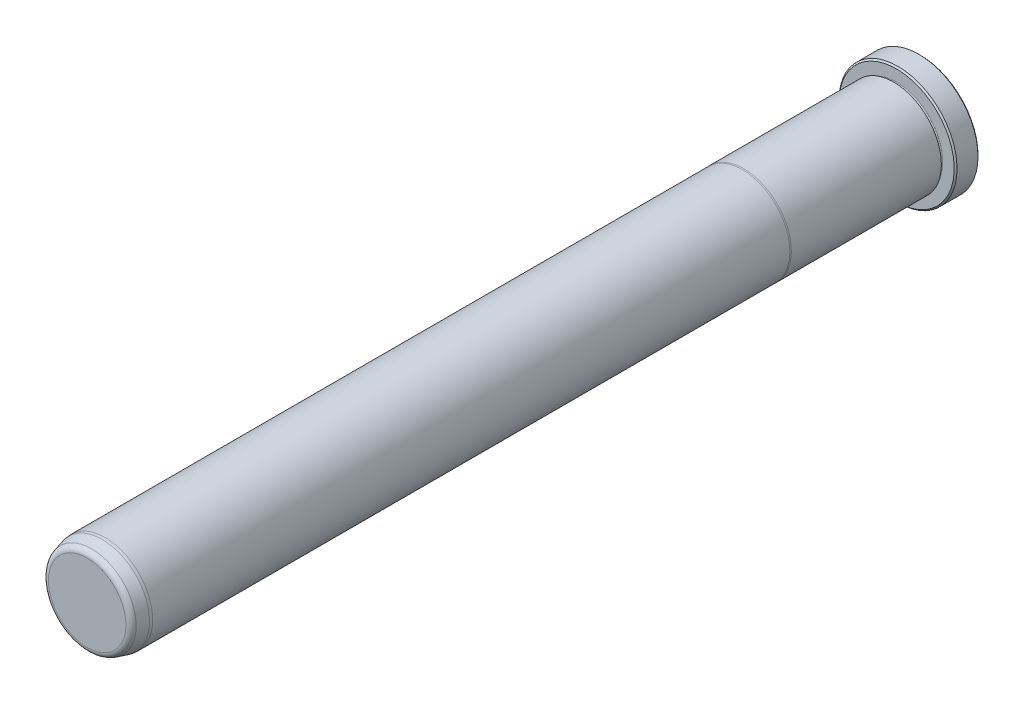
ISO-10303-21;
HEADER;
FILE_DESCRIPTION(('STEP AP214'),'2;1');
FILE_NAME('part.step','',(''),(''),'','','');
FILE_SCHEMA(('AUTOMOTIVE_DESIGN { 1 0 10303 214 1 1 1 1 }'));
ENDSEC;
DATA;
#1=APPLICATION_CONTEXT('core data for automotive mechanical design processes');
#2=APPLICATION_PROTOCOL_DEFINITION('international standard','automotive_design',2000,#1);
#3=PRODUCT_CONTEXT('',#1,'mechanical');
#4=PRODUCT('Part','Part','',(#3));
#5=PRODUCT_RELATED_PRODUCT_CATEGORY('part','',(#4));
#6=PRODUCT_DEFINITION_FORMATION('','',#4);
#7=PRODUCT_DEFINITION_CONTEXT('part definition',#1,'design');
#8=PRODUCT_DEFINITION('design','',#6,#7);
#9=PRODUCT_DEFINITION_SHAPE('','',#8);
#10=(LENGTH_UNIT() NAMED_UNIT(*) SI_UNIT(.MILLI.,.METRE.));
#11=(NAMED_UNIT(*) PLANE_ANGLE_UNIT() SI_UNIT($,.RADIAN.));
#12=(NAMED_UNIT(*) SI_UNIT($,.STERADIAN.) SOLID_ANGLE_UNIT());
#13=UNCERTAINTY_MEASURE_WITH_UNIT(LENGTH_MEASURE(1.E-05),#10,'distance_accuracy_value','');
#14=(GEOMETRIC_REPRESENTATION_CONTEXT(3) GLOBAL_UNCERTAINTY_ASSIGNED_CONTEXT((#13)) GLOBAL_UNIT_ASSIGNED_CONTEXT((#10,
#11,#12)) REPRESENTATION_CONTEXT('',''));
#15=CARTESIAN_POINT('',(0.,0.,0.));
#16=DIRECTION('',(0.,0.,1.));
#17=DIRECTION('',(1.,0.,0.));
#18=AXIS2_PLACEMENT_3D('',#15,#16,#17);
#19=CARTESIAN_POINT('',(0.,0.,0.));
#20=DIRECTION('',(0.,0.,1.));
#21=DIRECTION('',(1.,0.,0.));
#22=AXIS2_PLACEMENT_3D('',#19,#20,#21);
#23=PLANE('',#22);
#24=CARTESIAN_POINT('',(0.,0.,0.));
#25=DIRECTION('',(0.,0.,1.));
#26=DIRECTION('',(1.,0.,0.));
#27=AXIS2_PLACEMENT_3D('',#24,#25,#26);
#28=CIRCLE('',#27,15.367);
#29=CARTESIAN_POINT('',(15.367,0.,0.));
#30=VERTEX_POINT('',#29);
#31=EDGE_CURVE('E37',#30,#30,#28,.F.);
#32=ORIENTED_EDGE('',*,*,#31,.T.);
#33=EDGE_LOOP('',(#32));
#34=FACE_BOUND('',#33,.T.);
#35=ADVANCED_FACE('F30',(#34),#23,.F.);
#36=CARTESIAN_POINT('',(0.,0.,0.));
#37=DIRECTION('',(0.,0.,1.));
#38=DIRECTION('',(1.,0.,0.));
#39=AXIS2_PLACEMENT_3D('',#36,#37,#38);
#40=CYLINDRICAL_SURFACE('',#39,15.748);
#41=CARTESIAN_POINT('',(0.,0.,0.381000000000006));
#42=DIRECTION('',(0.,0.,1.));
#43=DIRECTION('',(1.,0.,0.));
#44=AXIS2_PLACEMENT_3D('',#41,#42,#43);
#45=CIRCLE('',#44,15.748);
#46=CARTESIAN_POINT('',(15.748,0.,0.381000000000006));
#47=VERTEX_POINT('',#46);
#48=EDGE_CURVE('E41',#47,#47,#45,.T.);
#49=ORIENTED_EDGE('',*,*,#48,.T.);
#50=EDGE_LOOP('',(#49));
#51=FACE_BOUND('',#50,.T.);
#52=CARTESIAN_POINT('',(0.,0.,5.96900000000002));
#53=DIRECTION('',(0.,0.,-1.));
#54=DIRECTION('',(-1.,0.,0.));
#55=AXIS2_PLACEMENT_3D('',#52,#53,#54);
#56=CIRCLE('',#55,15.748);
#57=CARTESIAN_POINT('',(-15.748,0.,5.96900000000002));
#58=VERTEX_POINT('',#57);
#59=EDGE_CURVE('E45',#58,#58,#56,.T.);
#60=ORIENTED_EDGE('',*,*,#59,.T.);
#61=EDGE_LOOP('',(#60));
#62=FACE_BOUND('',#61,.T.);
#63=ADVANCED_FACE('F118',(#51,#62),#40,.T.);
#64=CARTESIAN_POINT('',(0.,15.748,6.35));
#65=DIRECTION('',(0.,0.,-1.));
#66=DIRECTION('',(-1.,0.,0.));
#67=AXIS2_PLACEMENT_3D('',#64,#65,#66);
#68=PLANE('',#67);
#69=CARTESIAN_POINT('',(0.,0.,6.35));
#70=DIRECTION('',(0.,0.,-1.));
#71=DIRECTION('',(-1.,0.,0.));
#72=AXIS2_PLACEMENT_3D('',#69,#70,#71);
#73=CIRCLE('',#72,15.367);
#74=CARTESIAN_POINT('',(-15.367,0.,6.35));
#75=VERTEX_POINT('',#74);
#76=EDGE_CURVE('E10',#75,#75,#73,.F.);
#77=ORIENTED_EDGE('',*,*,#76,.T.);
#78=EDGE_LOOP('',(#77));
#79=FACE_BOUND('',#78,.T.);
#80=CARTESIAN_POINT('',(0.,0.,6.35));
#81=DIRECTION('',(0.,0.,1.));
#82=DIRECTION('',(1.,0.,0.));
#83=AXIS2_PLACEMENT_3D('',#80,#81,#82);
#84=CIRCLE('',#83,12.3063);
#85=CARTESIAN_POINT('',(12.3063,0.,6.35));
#86=VERTEX_POINT('',#85);
#87=EDGE_CURVE('E56',#86,#86,#84,.T.);
#88=ORIENTED_EDGE('',*,*,#87,.F.);
#89=EDGE_LOOP('',(#88));
#90=FACE_BOUND('',#89,.T.);
#91=ADVANCED_FACE('F113',(#79,#90),#68,.F.);
#92=CARTESIAN_POINT('',(0.,0.,6.731));
#93=DIRECTION('',(0.,0.,1.));
#94=DIRECTION('',(1.,0.,0.));
#95=AXIS2_PLACEMENT_3D('',#92,#93,#94);
#96=TOROIDAL_SURFACE('',#95,12.3063,0.381);
#97=CARTESIAN_POINT('',(0.,0.,7.112));
#98=DIRECTION('',(0.,0.,1.));
#99=DIRECTION('',(1.,0.,0.));
#100=AXIS2_PLACEMENT_3D('',#97,#98,#99);
#101=CIRCLE('',#100,12.3063);
#102=CARTESIAN_POINT('',(12.3063,0.,7.112));
#103=VERTEX_POINT('',#102);
#104=EDGE_CURVE('E59',#103,#103,#101,.T.);
#105=ORIENTED_EDGE('',*,*,#104,.F.);
#106=EDGE_LOOP('',(#105));
#107=FACE_BOUND('',#106,.T.);
#108=ORIENTED_EDGE('',*,*,#87,.T.);
#109=EDGE_LOOP('',(#108));
#110=FACE_BOUND('',#109,.T.);
#111=ADVANCED_FACE('F107',(#107,#110),#96,.F.);
#112=CARTESIAN_POINT('',(0.,12.3063,7.112));
#113=DIRECTION('',(0.,0.,1.));
#114=DIRECTION('',(1.,0.,0.));
#115=AXIS2_PLACEMENT_3D('',#112,#113,#114);
#116=PLANE('',#115);
#117=CARTESIAN_POINT('',(0.,0.,7.112));
#118=DIRECTION('',(0.,0.,1.));
#119=DIRECTION('',(1.,0.,0.));
#120=AXIS2_PLACEMENT_3D('',#117,#118,#119);
#121=CIRCLE('',#120,12.7127);
#122=CARTESIAN_POINT('',(12.7127,0.,7.112));
#123=VERTEX_POINT('',#122);
#124=EDGE_CURVE('E62',#123,#123,#121,.T.);
#125=ORIENTED_EDGE('',*,*,#124,.F.);
#126=EDGE_LOOP('',(#125));
#127=FACE_BOUND('',#126,.T.);
#128=ORIENTED_EDGE('',*,*,#104,.T.);
#129=EDGE_LOOP('',(#128));
#130=FACE_BOUND('',#129,.T.);
#131=ADVANCED_FACE('F101',(#127,#130),#116,.F.);
#132=CARTESIAN_POINT('',(0.,0.,0.));
#133=DIRECTION('',(0.,0.,1.));
#134=DIRECTION('',(1.,0.,0.));
#135=AXIS2_PLACEMENT_3D('',#132,#133,#134);
#136=CYLINDRICAL_SURFACE('',#135,12.7127);
#137=CARTESIAN_POINT('',(0.,0.,47.1347630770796));
#138=DIRECTION('',(0.,0.,1.));
#139=DIRECTION('',(1.,0.,0.));
#140=AXIS2_PLACEMENT_3D('',#137,#138,#139);
#141=CIRCLE('',#140,12.7127);
#142=CARTESIAN_POINT('',(12.7127,0.,47.1347630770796));
#143=VERTEX_POINT('',#142);
#144=EDGE_CURVE('E65',#143,#143,#141,.T.);
#145=ORIENTED_EDGE('',*,*,#144,.F.);
#146=EDGE_LOOP('',(#145));
#147=FACE_BOUND('',#146,.T.);
#148=ORIENTED_EDGE('',*,*,#124,.T.);
#149=EDGE_LOOP('',(#148));
#150=FACE_BOUND('',#149,.T.);
#151=ADVANCED_FACE('F95',(#147,#150),#136,.T.);
#152=CARTESIAN_POINT('',(0.,0.,47.1347630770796));
#153=DIRECTION('',(0.,0.,-1.));
#154=DIRECTION('',(-1.,0.,0.));
#155=AXIS2_PLACEMENT_3D('',#152,#153,#154);
#156=CONICAL_SURFACE('',#155,12.7127,0.0698131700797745);
#157=CARTESIAN_POINT('',(0.,0.,47.498));
#158=DIRECTION('',(0.,0.,1.));
#159=DIRECTION('',(1.,0.,0.));
#160=AXIS2_PLACEMENT_3D('',#157,#158,#159);
#161=CIRCLE('',#160,12.6873);
#162=CARTESIAN_POINT('',(12.6873,0.,47.498));
#163=VERTEX_POINT('',#162);
#164=EDGE_CURVE('E68',#163,#163,#161,.T.);
#165=ORIENTED_EDGE('',*,*,#164,.F.);
#166=EDGE_LOOP('',(#165));
#167=FACE_BOUND('',#166,.T.);
#168=ORIENTED_EDGE('',*,*,#144,.T.);
#169=EDGE_LOOP('',(#168));
#170=FACE_BOUND('',#169,.T.);
#171=ADVANCED_FACE('F89',(#167,#170),#156,.T.);
#172=CARTESIAN_POINT('',(0.,0.,0.));
#173=DIRECTION('',(0.,0.,1.));
#174=DIRECTION('',(1.,0.,0.));
#175=AXIS2_PLACEMENT_3D('',#172,#173,#174);
#176=CYLINDRICAL_SURFACE('',#175,12.6873);
#177=CARTESIAN_POINT('',(0.,0.,217.4875));
#178=DIRECTION('',(0.,0.,1.));
#179=DIRECTION('',(1.,0.,0.));
#180=AXIS2_PLACEMENT_3D('',#177,#178,#179);
#181=CIRCLE('',#180,12.6873);
#182=CARTESIAN_POINT('',(12.6873,0.,217.4875));
#183=VERTEX_POINT('',#182);
#184=EDGE_CURVE('E71',#183,#183,#181,.T.);
#185=ORIENTED_EDGE('',*,*,#184,.F.);
#186=EDGE_LOOP('',(#185));
#187=FACE_BOUND('',#186,.T.);
#188=ORIENTED_EDGE('',*,*,#164,.T.);
#189=EDGE_LOOP('',(#188));
#190=FACE_BOUND('',#189,.T.);
#191=ADVANCED_FACE('F83',(#187,#190),#176,.T.);
#192=CARTESIAN_POINT('',(0.,0.,217.4875));
#193=DIRECTION('',(0.,0.,-1.));
#194=DIRECTION('',(-1.,0.,0.));
#195=AXIS2_PLACEMENT_3D('',#192,#193,#194);
#196=CONICAL_SURFACE('',#195,12.6873,0.0872664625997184);
#197=CARTESIAN_POINT('',(0.,0.,218.2495));
#198=DIRECTION('',(0.,0.,1.));
#199=DIRECTION('',(1.,0.,0.));
#200=AXIS2_PLACEMENT_3D('',#197,#198,#199);
#201=CIRCLE('',#200,12.6206336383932);
#202=CARTESIAN_POINT('',(12.6206336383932,0.,218.2495));
#203=VERTEX_POINT('',#202);
#204=EDGE_CURVE('E74',#203,#203,#201,.T.);
#205=ORIENTED_EDGE('',*,*,#204,.F.);
#206=EDGE_LOOP('',(#205));
#207=FACE_BOUND('',#206,.T.);
#208=ORIENTED_EDGE('',*,*,#184,.T.);
#209=EDGE_LOOP('',(#208));
#210=FACE_BOUND('',#209,.T.);
#211=ADVANCED_FACE('F80',(#207,#210),#196,.T.);
#212=CARTESIAN_POINT('',(0.,0.,218.2495));
#213=DIRECTION('',(0.,0.,-1.));
#214=DIRECTION('',(-1.,0.,0.));
#215=AXIS2_PLACEMENT_3D('',#212,#213,#214);
#216=CONICAL_SURFACE('',#215,12.6206336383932,0.26179938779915);
#217=CARTESIAN_POINT('',(0.,0.,221.0733752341));
#218=DIRECTION('',(0.,0.,1.));
#219=DIRECTION('',(1.,0.,0.));
#220=AXIS2_PLACEMENT_3D('',#217,#218,#219);
#221=CIRCLE('',#220,11.8639785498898);
#222=CARTESIAN_POINT('',(11.8639785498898,0.,221.0733752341));
#223=VERTEX_POINT('',#222);
#224=EDGE_CURVE('E50',#223,#223,#221,.F.);
#225=ORIENTED_EDGE('',*,*,#224,.T.);
#226=EDGE_LOOP('',(#225));
#227=FACE_BOUND('',#226,.T.);
#228=ORIENTED_EDGE('',*,*,#204,.T.);
#229=EDGE_LOOP('',(#228));
#230=FACE_BOUND('',#229,.T.);
#231=ADVANCED_FACE('F78',(#227,#230),#216,.T.);
#232=CARTESIAN_POINT('',(0.,11.5487028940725,222.25));
#233=DIRECTION('',(0.,0.,-1.));
#234=DIRECTION('',(-1.,0.,0.));
#235=AXIS2_PLACEMENT_3D('',#232,#233,#234);
#236=PLANE('',#235);
#237=CARTESIAN_POINT('',(0.,0.,222.25));
#238=DIRECTION('',(0.,0.,-1.));
#239=DIRECTION('',(-1.,0.,0.));
#240=AXIS2_PLACEMENT_3D('',#237,#238,#239);
#241=CIRCLE('',#240,10.3305713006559);
#242=CARTESIAN_POINT('',(-10.3305713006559,0.,222.25));
#243=VERTEX_POINT('',#242);
#244=EDGE_CURVE('E53',#243,#243,#241,.F.);
#245=ORIENTED_EDGE('',*,*,#244,.T.);
#246=EDGE_LOOP('',(#245));
#247=FACE_BOUND('',#246,.T.);
#248=ADVANCED_FACE('F133',(#247),#236,.F.);
#249=CARTESIAN_POINT('',(0.,0.,220.6625));
#250=DIRECTION('',(0.,0.,-1.));
#251=DIRECTION('',(-1.,0.,0.));
#252=AXIS2_PLACEMENT_3D('',#249,#250,#251);
#253=TOROIDAL_SURFACE('',#252,10.3305713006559,1.5875);
#254=ORIENTED_EDGE('',*,*,#224,.F.);
#255=EDGE_LOOP('',(#254));
#256=FACE_BOUND('',#255,.T.);
#257=ORIENTED_EDGE('',*,*,#244,.F.);
#258=EDGE_LOOP('',(#257));
#259=FACE_BOUND('',#258,.T.);
#260=ADVANCED_FACE('F130',(#256,#259),#253,.T.);
#261=CARTESIAN_POINT('',(0.,0.,0.381000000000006));
#262=DIRECTION('',(0.,0.,1.));
#263=DIRECTION('',(1.,0.,0.));
#264=AXIS2_PLACEMENT_3D('',#261,#262,#263);
#265=CONICAL_SURFACE('',#264,15.748,0.785398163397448);
#266=CARTESIAN_POINT('',(15.367,0.,0.));
#267=CARTESIAN_POINT('',(15.37096875,0.,0.00396874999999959));
#268=CARTESIAN_POINT('',(15.3749375,0.,0.00793749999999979));
#269=CARTESIAN_POINT('',(15.382875,0.,0.0158750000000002));
#270=CARTESIAN_POINT('',(15.38684375,0.,0.0198437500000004));
#271=CARTESIAN_POINT('',(15.39478125,0.,0.0277812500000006));
#272=CARTESIAN_POINT('',(15.39875,0.,0.0317500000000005));
#273=CARTESIAN_POINT('',(15.4066875,0.,0.0396875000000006));
#274=CARTESIAN_POINT('',(15.41065625,0.,0.0436562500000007));
#275=CARTESIAN_POINT('',(15.41859375,0.,0.0515937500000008));
#276=CARTESIAN_POINT('',(15.4225625,0.,0.0555625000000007));
#277=CARTESIAN_POINT('',(15.4305,0.,0.0635000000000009));
#278=CARTESIAN_POINT('',(15.43446875,0.,0.0674687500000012));
#279=CARTESIAN_POINT('',(15.44240625,0.,0.0754062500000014));
#280=CARTESIAN_POINT('',(15.446375,0.,0.0793750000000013));
#281=CARTESIAN_POINT('',(15.4543125,0.,0.0873125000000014));
#282=CARTESIAN_POINT('',(15.45828125,0.,0.0912812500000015));
#283=CARTESIAN_POINT('',(15.46621875,0.,0.0992187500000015));
#284=CARTESIAN_POINT('',(15.4701875,0.,0.103187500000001));
#285=CARTESIAN_POINT('',(15.478125,0.,0.111125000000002));
#286=CARTESIAN_POINT('',(15.48209375,0.,0.115093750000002));
#287=CARTESIAN_POINT('',(15.49003125,0.,0.123031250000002));
#288=CARTESIAN_POINT('',(15.494,0.,0.127000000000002));
#289=CARTESIAN_POINT('',(15.5019375,0.,0.134937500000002));
#290=CARTESIAN_POINT('',(15.50590625,0.,0.138906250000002));
#291=CARTESIAN_POINT('',(15.51384375,0.,0.146843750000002));
#292=CARTESIAN_POINT('',(15.5178125,0.,0.150812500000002));
#293=CARTESIAN_POINT('',(15.52575,0.,0.158750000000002));
#294=CARTESIAN_POINT('',(15.52971875,0.,0.162718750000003));
#295=CARTESIAN_POINT('',(15.53765625,0.,0.170656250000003));
#296=CARTESIAN_POINT('',(15.541625,0.,0.174625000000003));
#297=CARTESIAN_POINT('',(15.5495625,0.,0.182562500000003));
#298=CARTESIAN_POINT('',(15.55353125,0.,0.186531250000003));
#299=CARTESIAN_POINT('',(15.56146875,0.,0.194468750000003));
#300=CARTESIAN_POINT('',(15.5654375,0.,0.198437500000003));
#301=CARTESIAN_POINT('',(15.573375,0.,0.206375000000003));
#302=CARTESIAN_POINT('',(15.57734375,0.,0.210343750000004));
#303=CARTESIAN_POINT('',(15.58528125,0.,0.218281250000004));
#304=CARTESIAN_POINT('',(15.58925,0.,0.222250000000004));
#305=CARTESIAN_POINT('',(15.5971875,0.,0.230187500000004));
#306=CARTESIAN_POINT('',(15.60115625,0.,0.234156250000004));
#307=CARTESIAN_POINT('',(15.60909375,0.,0.242093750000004));
#308=CARTESIAN_POINT('',(15.6130625,0.,0.246062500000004));
#309=CARTESIAN_POINT('',(15.621,0.,0.254000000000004));
#310=CARTESIAN_POINT('',(15.62496875,0.,0.257968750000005));
#311=CARTESIAN_POINT('',(15.63290625,0.,0.265906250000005));
#312=CARTESIAN_POINT('',(15.636875,0.,0.269875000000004));
#313=CARTESIAN_POINT('',(15.6448125,0.,0.277812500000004));
#314=CARTESIAN_POINT('',(15.64878125,0.,0.281781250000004));
#315=CARTESIAN_POINT('',(15.65671875,0.,0.289718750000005));
#316=CARTESIAN_POINT('',(15.6606875,0.,0.293687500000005));
#317=CARTESIAN_POINT('',(15.668625,0.,0.301625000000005));
#318=CARTESIAN_POINT('',(15.67259375,0.,0.305593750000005));
#319=CARTESIAN_POINT('',(15.68053125,0.,0.313531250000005));
#320=CARTESIAN_POINT('',(15.6845,0.,0.317500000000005));
#321=CARTESIAN_POINT('',(15.6924375,0.,0.325437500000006));
#322=CARTESIAN_POINT('',(15.69640625,0.,0.329406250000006));
#323=CARTESIAN_POINT('',(15.70434375,0.,0.337343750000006));
#324=CARTESIAN_POINT('',(15.7083125,0.,0.341312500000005));
#325=CARTESIAN_POINT('',(15.71625,0.,0.349250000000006));
#326=CARTESIAN_POINT('',(15.72021875,0.,0.353218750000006));
#327=CARTESIAN_POINT('',(15.72815625,0.,0.361156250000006));
#328=CARTESIAN_POINT('',(15.732125,0.,0.365125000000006));
#329=CARTESIAN_POINT('',(15.7400625,0.,0.373062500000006));
#330=CARTESIAN_POINT('',(15.74403125,0.,0.377031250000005));
#331=CARTESIAN_POINT('',(15.748,0.,0.381000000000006));
#332=B_SPLINE_CURVE_WITH_KNOTS('',3,(#266,#267,#268,#269,#270,#271,#272,#273,#274,#275,#276,
#277,#278,#279,#280,#281,#282,#283,#284,#285,#286,#287,#288,#289,#290,#291,#292,#293,#294,#295,
#296,#297,#298,#299,#300,#301,#302,#303,#304,#305,#306,#307,#308,#309,#310,#311,#312,#313,#314,
#315,#316,#317,#318,#319,#320,#321,#322,#323,#324,#325,#326,#327,#328,#329,#330,#331),
.UNSPECIFIED.,.F.,.F.,(4,2,2,2,2,2,2,2,2,2,2,2,2,2,2,2,2,2,2,2,2,2,2,2,2,2,2,2,2,2,2,2,4),(0.,
0.0168379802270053,0.0336759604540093,0.0505139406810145,0.0673519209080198,0.084189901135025,
0.101027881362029,0.117865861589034,0.13470384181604,0.151541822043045,0.168379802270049,
0.185217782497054,0.202055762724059,0.218893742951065,0.235731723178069,0.252569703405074,
0.269407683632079,0.286245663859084,0.303083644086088,0.319921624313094,0.336759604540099,
0.353597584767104,0.370435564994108,0.387273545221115,0.404111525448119,0.420949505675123,
0.437787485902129,0.454625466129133,0.471463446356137,0.488301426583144,0.505139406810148,
0.521977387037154,0.538815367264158),.UNSPECIFIED.);
#333=EDGE_CURVE('BSEAM132',#30,#47,#332,.T.);
#334=ORIENTED_EDGE('',*,*,#31,.F.);
#335=ORIENTED_EDGE('',*,*,#48,.F.);
#336=ORIENTED_EDGE('',*,*,#333,.T.);
#337=ORIENTED_EDGE('',*,*,#333,.F.);
#338=EDGE_LOOP('',(#334,#336,#335,#337));
#339=FACE_BOUND('',#338,.T.);
#340=ADVANCED_FACE('F132',(#339),#265,.T.);
#341=CARTESIAN_POINT('',(0.,0.,6.35));
#342=DIRECTION('',(0.,0.,-1.));
#343=DIRECTION('',(-1.,0.,0.));
#344=AXIS2_PLACEMENT_3D('',#341,#342,#343);
#345=CONICAL_SURFACE('',#344,15.367,0.785398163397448);
#346=ORIENTED_EDGE('',*,*,#59,.F.);
#347=EDGE_LOOP('',(#346));
#348=FACE_BOUND('',#347,.T.);
#349=ORIENTED_EDGE('',*,*,#76,.F.);
#350=EDGE_LOOP('',(#349));
#351=FACE_BOUND('',#350,.T.);
#352=ADVANCED_FACE('F32',(#348,#351),#345,.T.);
#353=CLOSED_SHELL('',(#35,#63,#91,#111,#131,#151,#171,#191,#211,#231,#248,#260,#340,#352));
#354=MANIFOLD_SOLID_BREP('B2',#353);
#355=ADVANCED_BREP_SHAPE_REPRESENTATION('',(#18,#354),#14);
#356=SHAPE_DEFINITION_REPRESENTATION(#9,#355);
ENDSEC;
END-ISO-10303-21;
